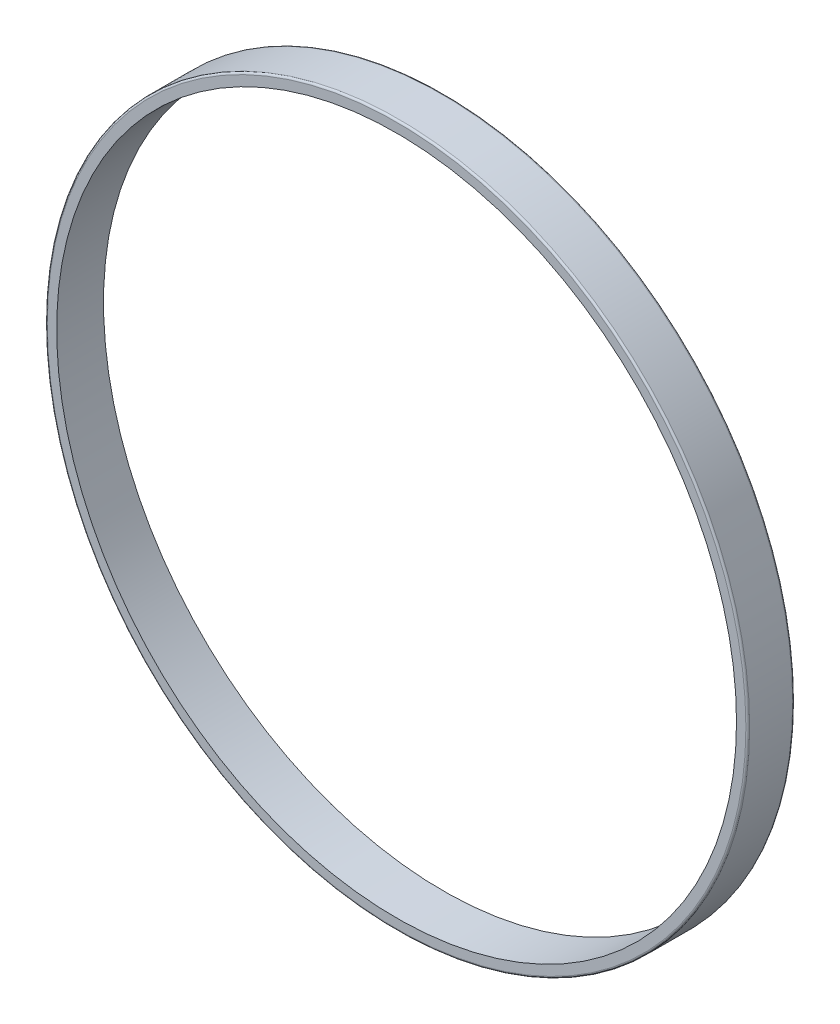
ISO-10303-21;
HEADER;
FILE_DESCRIPTION(('STEP AP214'),'2;1');
FILE_NAME('part.step','',(''),(''),'','','');
FILE_SCHEMA(('AUTOMOTIVE_DESIGN { 1 0 10303 214 1 1 1 1 }'));
ENDSEC;
DATA;
#1=APPLICATION_CONTEXT('core data for automotive mechanical design processes');
#2=APPLICATION_PROTOCOL_DEFINITION('international standard','automotive_design',2000,#1);
#3=PRODUCT_CONTEXT('',#1,'mechanical');
#4=PRODUCT('Part','Part','',(#3));
#5=PRODUCT_RELATED_PRODUCT_CATEGORY('part','',(#4));
#6=PRODUCT_DEFINITION_FORMATION('','',#4);
#7=PRODUCT_DEFINITION_CONTEXT('part definition',#1,'design');
#8=PRODUCT_DEFINITION('design','',#6,#7);
#9=PRODUCT_DEFINITION_SHAPE('','',#8);
#10=(LENGTH_UNIT() NAMED_UNIT(*) SI_UNIT(.MILLI.,.METRE.));
#11=(NAMED_UNIT(*) PLANE_ANGLE_UNIT() SI_UNIT($,.RADIAN.));
#12=(NAMED_UNIT(*) SI_UNIT($,.STERADIAN.) SOLID_ANGLE_UNIT());
#13=UNCERTAINTY_MEASURE_WITH_UNIT(LENGTH_MEASURE(1.E-05),#10,'distance_accuracy_value','');
#14=(GEOMETRIC_REPRESENTATION_CONTEXT(3) GLOBAL_UNCERTAINTY_ASSIGNED_CONTEXT((#13)) GLOBAL_UNIT_ASSIGNED_CONTEXT((#10,
#11,#12)) REPRESENTATION_CONTEXT('',''));
#15=CARTESIAN_POINT('',(0.,0.,0.));
#16=DIRECTION('',(0.,0.,1.));
#17=DIRECTION('',(1.,0.,0.));
#18=AXIS2_PLACEMENT_3D('',#15,#16,#17);
#19=CARTESIAN_POINT('',(0.,0.,5.));
#20=DIRECTION('',(0.,0.,1.));
#21=DIRECTION('',(1.,0.,0.));
#22=AXIS2_PLACEMENT_3D('',#19,#20,#21);
#23=PLANE('',#22);
#24=CARTESIAN_POINT('',(0.,0.,5.));
#25=DIRECTION('',(0.,0.,1.));
#26=DIRECTION('',(1.,0.,0.));
#27=AXIS2_PLACEMENT_3D('',#24,#25,#26);
#28=CIRCLE('',#27,37.3);
#29=CARTESIAN_POINT('',(37.3,0.,5.));
#30=VERTEX_POINT('',#29);
#31=EDGE_CURVE('E10',#30,#30,#28,.T.);
#32=ORIENTED_EDGE('',*,*,#31,.T.);
#33=EDGE_LOOP('',(#32));
#34=FACE_BOUND('',#33,.T.);
#35=CARTESIAN_POINT('',(0.,0.,5.));
#36=DIRECTION('',(0.,0.,1.));
#37=DIRECTION('',(1.,0.,0.));
#38=AXIS2_PLACEMENT_3D('',#35,#36,#37);
#39=CIRCLE('',#38,36.3);
#40=CARTESIAN_POINT('',(36.3,0.,5.));
#41=VERTEX_POINT('',#40);
#42=EDGE_CURVE('E57',#41,#41,#39,.T.);
#43=ORIENTED_EDGE('',*,*,#42,.F.);
#44=EDGE_LOOP('',(#43));
#45=FACE_BOUND('',#44,.T.);
#46=ADVANCED_FACE('F37',(#34,#45),#23,.T.);
#47=CARTESIAN_POINT('',(0.,0.,0.));
#48=DIRECTION('',(0.,0.,1.));
#49=DIRECTION('',(1.,0.,0.));
#50=AXIS2_PLACEMENT_3D('',#47,#48,#49);
#51=PLANE('',#50);
#52=CARTESIAN_POINT('',(0.,0.,0.));
#53=DIRECTION('',(0.,0.,1.));
#54=DIRECTION('',(1.,0.,0.));
#55=AXIS2_PLACEMENT_3D('',#52,#53,#54);
#56=CIRCLE('',#55,37.3);
#57=CARTESIAN_POINT('',(37.3,0.,0.));
#58=VERTEX_POINT('',#57);
#59=EDGE_CURVE('E44',#58,#58,#56,.F.);
#60=ORIENTED_EDGE('',*,*,#59,.T.);
#61=EDGE_LOOP('',(#60));
#62=FACE_BOUND('',#61,.T.);
#63=CARTESIAN_POINT('',(0.,0.,0.));
#64=DIRECTION('',(0.,0.,1.));
#65=DIRECTION('',(1.,0.,0.));
#66=AXIS2_PLACEMENT_3D('',#63,#64,#65);
#67=CIRCLE('',#66,36.3);
#68=CARTESIAN_POINT('',(36.3,0.,0.));
#69=VERTEX_POINT('',#68);
#70=EDGE_CURVE('E58',#69,#69,#67,.T.);
#71=ORIENTED_EDGE('',*,*,#70,.T.);
#72=EDGE_LOOP('',(#71));
#73=FACE_BOUND('',#72,.T.);
#74=ADVANCED_FACE('F68',(#62,#73),#51,.F.);
#75=CARTESIAN_POINT('',(0.,0.,5.));
#76=DIRECTION('',(0.,0.,-1.));
#77=DIRECTION('',(-1.,0.,0.));
#78=AXIS2_PLACEMENT_3D('',#75,#76,#77);
#79=CYLINDRICAL_SURFACE('',#78,37.5);
#80=CARTESIAN_POINT('',(0.,0.,0.2));
#81=DIRECTION('',(0.,0.,1.));
#82=DIRECTION('',(1.,0.,0.));
#83=AXIS2_PLACEMENT_3D('',#80,#81,#82);
#84=CIRCLE('',#83,37.5);
#85=CARTESIAN_POINT('',(37.5,0.,0.2));
#86=VERTEX_POINT('',#85);
#87=EDGE_CURVE('E48',#86,#86,#84,.T.);
#88=ORIENTED_EDGE('',*,*,#87,.T.);
#89=EDGE_LOOP('',(#88));
#90=FACE_BOUND('',#89,.T.);
#91=CARTESIAN_POINT('',(0.,0.,4.8));
#92=DIRECTION('',(0.,0.,1.));
#93=DIRECTION('',(1.,0.,0.));
#94=AXIS2_PLACEMENT_3D('',#91,#92,#93);
#95=CIRCLE('',#94,37.5);
#96=CARTESIAN_POINT('',(37.5,0.,4.8));
#97=VERTEX_POINT('',#96);
#98=EDGE_CURVE('E52',#97,#97,#95,.F.);
#99=ORIENTED_EDGE('',*,*,#98,.T.);
#100=EDGE_LOOP('',(#99));
#101=FACE_BOUND('',#100,.T.);
#102=ADVANCED_FACE('F73',(#90,#101),#79,.T.);
#103=CARTESIAN_POINT('',(0.,0.,5.));
#104=DIRECTION('',(0.,0.,-1.));
#105=DIRECTION('',(-1.,0.,0.));
#106=AXIS2_PLACEMENT_3D('',#103,#104,#105);
#107=CYLINDRICAL_SURFACE('',#106,36.3);
#108=ORIENTED_EDGE('',*,*,#42,.T.);
#109=EDGE_LOOP('',(#108));
#110=FACE_BOUND('',#109,.T.);
#111=ORIENTED_EDGE('',*,*,#70,.F.);
#112=EDGE_LOOP('',(#111));
#113=FACE_BOUND('',#112,.T.);
#114=ADVANCED_FACE('F64',(#110,#113),#107,.F.);
#115=CARTESIAN_POINT('',(0.,0.,0.2));
#116=DIRECTION('',(0.,0.,1.));
#117=DIRECTION('',(1.,0.,0.));
#118=AXIS2_PLACEMENT_3D('',#115,#116,#117);
#119=TOROIDAL_SURFACE('',#118,37.3,0.2);
#120=ORIENTED_EDGE('',*,*,#59,.F.);
#121=EDGE_LOOP('',(#120));
#122=FACE_BOUND('',#121,.T.);
#123=ORIENTED_EDGE('',*,*,#87,.F.);
#124=EDGE_LOOP('',(#123));
#125=FACE_BOUND('',#124,.T.);
#126=ADVANCED_FACE('F79',(#122,#125),#119,.T.);
#127=CARTESIAN_POINT('',(0.,0.,4.8));
#128=DIRECTION('',(0.,0.,1.));
#129=DIRECTION('',(1.,0.,0.));
#130=AXIS2_PLACEMENT_3D('',#127,#128,#129);
#131=TOROIDAL_SURFACE('',#130,37.3,0.2);
#132=ORIENTED_EDGE('',*,*,#98,.F.);
#133=EDGE_LOOP('',(#132));
#134=FACE_BOUND('',#133,.T.);
#135=ORIENTED_EDGE('',*,*,#31,.F.);
#136=EDGE_LOOP('',(#135));
#137=FACE_BOUND('',#136,.T.);
#138=ADVANCED_FACE('F39',(#134,#137),#131,.T.);
#139=CLOSED_SHELL('',(#46,#74,#102,#114,#126,#138));
#140=MANIFOLD_SOLID_BREP('B2',#139);
#141=ADVANCED_BREP_SHAPE_REPRESENTATION('',(#18,#140),#14);
#142=SHAPE_DEFINITION_REPRESENTATION(#9,#141);
ENDSEC;
END-ISO-10303-21;
